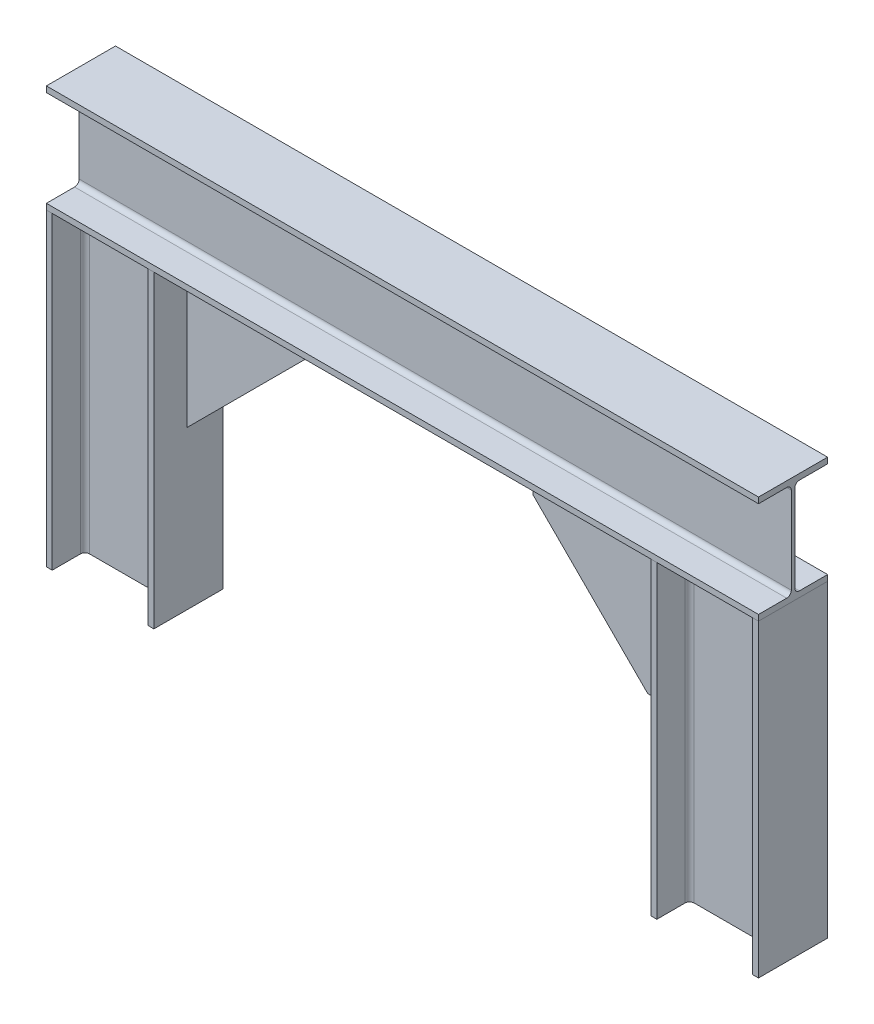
from build123d import *

# Parameters (mm, degrees)
AL_I_BEAM_AL_I_BEAM_7X5_8_1_DEPTH   = 600
AL_I_BEAM_AL_I_BEAM_7X5_8_1_2_DEPTH = 600
AL_I_BEAM_AL_I_BEAM_7X5_8_3_DEPTH   = 1000
GUSSET1_THICKNESS                   = 5
GUSSET2_THICKNESS                   = 5
BODY_3_RUN_ON_DEPTH                 = 88.9
BODY_START                          = 1000
BODY_3_RUN_ON_2_DEPTH               = 88.9


with BuildPart() as part:
    # Sketch110 → Al i beam AL I BEAM 7X5.8_1 (new body)
    with BuildSketch(Plane(origin=(-500, 0, 0), x_dir=(0, 0, 1), z_dir=(0, -1, 0))):
        with BuildLine():
            Line((-57.15, -88.9), (-57.15, -79.248))
            Line((-57.15, -79.248), (-10.541, -79.248))
            ThreePointArc((-10.541, -79.248), (-5.152846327, -77.016153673), (-2.921, -71.628))
            Line((-2.921, -71.628), (-2.921, 71.628))
            ThreePointArc((-2.921, 71.628), (-5.152846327, 77.016153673), (-10.541, 79.248))
            Line((-10.541, 79.248), (-57.15, 79.248))
            Line((-57.15, 79.248), (-57.15, 88.9))
            Line((-57.15, 88.9), (57.15, 88.9))
            Line((57.15, 88.9), (57.15, 79.248))
            Line((57.15, 79.248), (10.541, 79.248))
            ThreePointArc((10.541, 79.248), (5.152846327, 77.016153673), (2.921, 71.628))
            Line((2.921, 71.628), (2.921, -71.628))
            ThreePointArc((2.921, -71.628), (5.152846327, -77.016153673), (10.541, -79.248))
            Line((10.541, -79.248), (57.15, -79.248))
            Line((57.15, -79.248), (57.15, -88.9))
            Line((57.15, -88.9), (-57.15, -88.9))
        make_face()
    extrude(amount=AL_I_BEAM_AL_I_BEAM_7X5_8_1_DEPTH)

    # Trim_Extend3 7
    split(bisect_by=Plane.XZ.offset(88.9), keep=Keep.TOP)


with BuildPart() as body_2:
    # Sketch110 on segment 2 (on carried to segment 2) → Al i beam AL I BEAM 7X5.8_1 2 (new body)
    with BuildSketch(Plane(origin=(500, 0, 0), x_dir=(0, 0, 1), z_dir=(0, -1, 0))):
        with BuildLine():
            Line((-57.15, -88.9), (-57.15, -79.248))
            Line((-57.15, -79.248), (-10.541, -79.248))
            ThreePointArc((-10.541, -79.248), (-5.152846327, -77.016153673), (-2.921, -71.628))
            Line((-2.921, -71.628), (-2.921, 71.628))
            ThreePointArc((-2.921, 71.628), (-5.152846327, 77.016153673), (-10.541, 79.248))
            Line((-10.541, 79.248), (-57.15, 79.248))
            Line((-57.15, 79.248), (-57.15, 88.9))
            Line((-57.15, 88.9), (57.15, 88.9))
            Line((57.15, 88.9), (57.15, 79.248))
            Line((57.15, 79.248), (10.541, 79.248))
            ThreePointArc((10.541, 79.248), (5.152846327, 77.016153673), (2.921, 71.628))
            Line((2.921, 71.628), (2.921, -71.628))
            ThreePointArc((2.921, -71.628), (5.152846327, -77.016153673), (10.541, -79.248))
            Line((10.541, -79.248), (57.15, -79.248))
            Line((57.15, -79.248), (57.15, -88.9))
            Line((57.15, -88.9), (-57.15, -88.9))
        make_face()
    extrude(amount=AL_I_BEAM_AL_I_BEAM_7X5_8_1_2_DEPTH)

    # Trim_Extend4 7
    split(bisect_by=Plane(origin=(-44.45, -88.9, 0), x_dir=(1, 0, 0), z_dir=(0, -1, 0)), keep=Keep.TOP)


with BuildPart() as body_3:
    # Sketch111 → Al i beam AL I BEAM 7X5.8_3 (new body)
    with BuildSketch(Plane(origin=(-500, 0, 0), x_dir=(0, 0, 1), z_dir=(1, 0, 0))):
        with BuildLine():
            Line((-57.15, -88.9), (-57.15, -79.248))
            Line((-57.15, -79.248), (-10.541, -79.248))
            ThreePointArc((-10.541, -79.248), (-5.152846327, -77.016153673), (-2.921, -71.628))
            Line((-2.921, -71.628), (-2.921, 71.628))
            ThreePointArc((-2.921, 71.628), (-5.152846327, 77.016153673), (-10.541, 79.248))
            Line((-10.541, 79.248), (-57.15, 79.248))
            Line((-57.15, 79.248), (-57.15, 88.9))
            Line((-57.15, 88.9), (57.15, 88.9))
            Line((57.15, 88.9), (57.15, 79.248))
            Line((57.15, 79.248), (10.541, 79.248))
            ThreePointArc((10.541, 79.248), (5.152846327, 77.016153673), (2.921, 71.628))
            Line((2.921, 71.628), (2.921, -71.628))
            ThreePointArc((2.921, -71.628), (5.152846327, -77.016153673), (10.541, -79.248))
            Line((10.541, -79.248), (57.15, -79.248))
            Line((57.15, -79.248), (57.15, -88.9))
            Line((57.15, -88.9), (-57.15, -88.9))
        make_face()
    extrude(amount=AL_I_BEAM_AL_I_BEAM_7X5_8_3_DEPTH)

    # Sketch111 → body 3 run on (add)
    with BuildSketch(Plane(origin=(-500, 0, 0), x_dir=(0, 0, 1), z_dir=(1, 0, 0))):
        with BuildLine():
            Line((-57.15, -88.9), (-57.15, -79.248))
            Line((-57.15, -79.248), (-10.541, -79.248))
            ThreePointArc((-10.541, -79.248), (-5.152846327, -77.016153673), (-2.921, -71.628))
            Line((-2.921, -71.628), (-2.921, 71.628))
            ThreePointArc((-2.921, 71.628), (-5.152846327, 77.016153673), (-10.541, 79.248))
            Line((-10.541, 79.248), (-57.15, 79.248))
            Line((-57.15, 79.248), (-57.15, 88.9))
            Line((-57.15, 88.9), (57.15, 88.9))
            Line((57.15, 88.9), (57.15, 79.248))
            Line((57.15, 79.248), (10.541, 79.248))
            ThreePointArc((10.541, 79.248), (5.152846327, 77.016153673), (2.921, 71.628))
            Line((2.921, 71.628), (2.921, -71.628))
            ThreePointArc((2.921, -71.628), (5.152846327, -77.016153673), (10.541, -79.248))
            Line((10.541, -79.248), (57.15, -79.248))
            Line((57.15, -79.248), (57.15, -88.9))
            Line((57.15, -88.9), (-57.15, -88.9))
        make_face()
    extrude(amount=-BODY_3_RUN_ON_DEPTH)

    # Sketch111 → body 3 run on 2 (add)
    with BuildSketch(Plane(origin=(-500, 0, 0), x_dir=(0, 0, 1), z_dir=(1, 0, 0)).offset(BODY_START)):
        with BuildLine():
            Line((-57.15, -88.9), (-57.15, -79.248))
            Line((-57.15, -79.248), (-10.541, -79.248))
            ThreePointArc((-10.541, -79.248), (-5.152846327, -77.016153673), (-2.921, -71.628))
            Line((-2.921, -71.628), (-2.921, 71.628))
            ThreePointArc((-2.921, 71.628), (-5.152846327, 77.016153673), (-10.541, 79.248))
            Line((-10.541, 79.248), (-57.15, 79.248))
            Line((-57.15, 79.248), (-57.15, 88.9))
            Line((-57.15, 88.9), (57.15, 88.9))
            Line((57.15, 88.9), (57.15, 79.248))
            Line((57.15, 79.248), (10.541, 79.248))
            ThreePointArc((10.541, 79.248), (5.152846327, 77.016153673), (2.921, 71.628))
            Line((2.921, 71.628), (2.921, -71.628))
            ThreePointArc((2.921, -71.628), (5.152846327, -77.016153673), (10.541, -79.248))
            Line((10.541, -79.248), (57.15, -79.248))
            Line((57.15, -79.248), (57.15, -88.9))
            Line((57.15, -88.9), (-57.15, -88.9))
        make_face()
    extrude(amount=BODY_3_RUN_ON_2_DEPTH)


with BuildPart() as body_4:
    # Gusset1: a gusset: a plate 5.0 thick in the corner of two members, its outline drawn in place
    gusset1_outline = Wire([Line((-411.1, -88.9, -2.5), (-161.1, -88.9, -2.5)), Line((-161.1, -88.9, -2.5), (-411.1, -338.9, -2.5)), Line((-411.1, -338.9, -2.5), (-411.1, -88.9, -2.5))])
    add(extrude(Face(gusset1_outline), amount=GUSSET1_THICKNESS, dir=(0, 0, 1)))


with BuildPart() as body_5:
    # Gusset2: a gusset: a plate 5.0 thick in the corner of two members, its outline drawn in place
    gusset2_outline = Wire([Line((411.1, -88.9, 2.5), (161.1, -88.9, 2.5)), Line((161.1, -88.9, 2.5), (161.1, -148.9, 2.5)), Line((161.1, -148.9, 2.5), (351.1, -338.9, 2.5)), Line((351.1, -338.9, 2.5), (411.1, -338.9, 2.5)), Line((411.1, -338.9, 2.5), (411.1, -88.9, 2.5))])
    add(extrude(Face(gusset2_outline), amount=GUSSET2_THICKNESS, dir=(0, 0, -1)))


solid = Compound([part.part, body_2.part, body_3.part, body_4.part, body_5.part])
